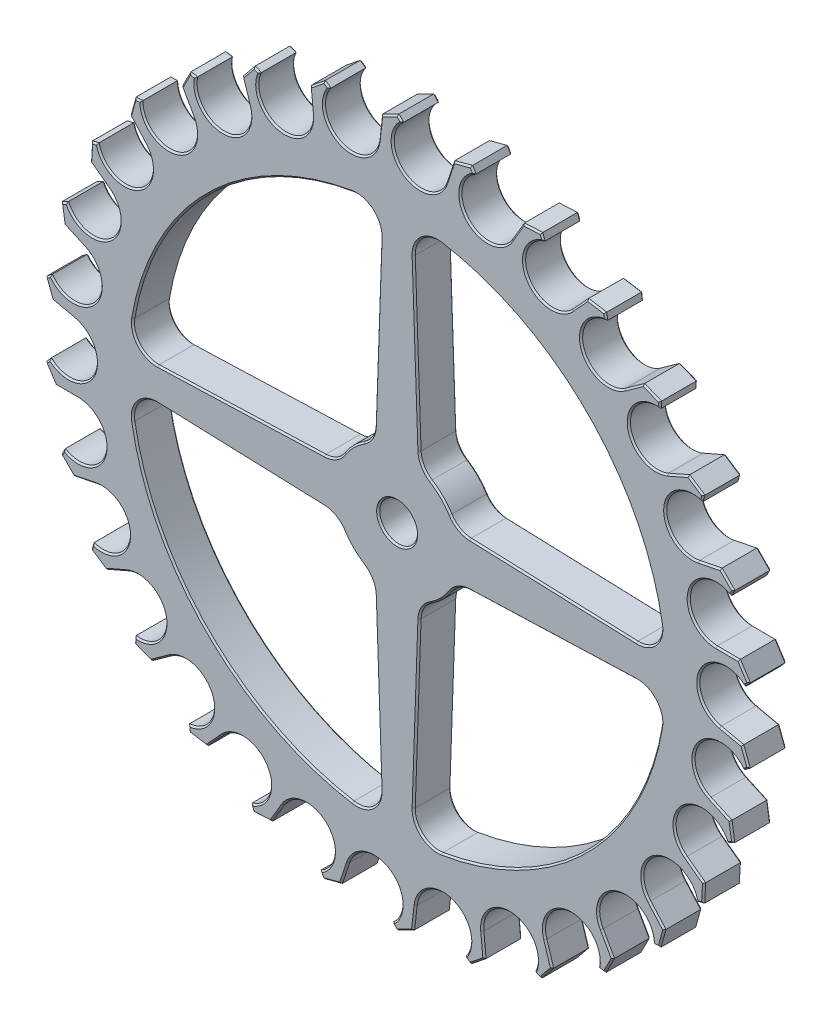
from build123d import *

# Parameters (mm, degrees)
SKETCH_1_R      = 3
EXTRUDE_1_DEPTH = 6
CHAMFER_1_SIZE  = 0.25


with BuildPart() as part:
    # Sketch 1 → Extrude 1 (new body)
    with BuildSketch(Plane.XY):
        with BuildLine():
            Line((-13.882887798, 53.121905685), (-13.530618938, 49.490786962))
            ThreePointArc((-13.530618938, 49.490786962), (-18.601788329, 44.784411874), (-21.797253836, 50.920838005))
            Line((-21.797253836, 50.920838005), (-22.788591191, 51.328605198))
            Line((-22.788591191, 51.328605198), (-24.624178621, 49.074649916))
            Line((-24.624178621, 49.074649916), (-23.524655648, 45.596120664))
            ThreePointArc((-23.524655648, 45.596120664), (-27.506497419, 39.938235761), (-31.90796907, 45.276191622))
            Line((-31.90796907, 45.276191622), (-32.962422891, 45.468937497))
            Line((-32.962422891, 45.468937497), (-34.289274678, 42.882596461))
            Line((-34.289274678, 42.882596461), (-32.490552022, 39.708685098))
            ThreePointArc((-32.490552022, 39.708685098), (-35.20904058, 33.3465671), (-40.624152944, 37.652758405))
            Line((-40.624152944, 37.652758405), (-41.69563854, 37.622059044))
            Line((-41.69563854, 37.622059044), (-42.455764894, 34.816367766))
            Line((-42.455764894, 34.816367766), (-40.036455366, 32.085789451))
            ThreePointArc((-40.036455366, 32.085789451), (-41.372779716, 25.297493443), (-47.564866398, 28.383718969))
            Line((-47.564866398, 28.383718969), (-48.606554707, 28.13091608))
            Line((-48.606554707, 28.13091608), (-48.766734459, 25.228496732))
            Line((-48.766734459, 25.228496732), (-45.832573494, 23.06059084))
            ThreePointArc((-45.832573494, 23.06059084), (-45.72832985, 16.142797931), (-52.426766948, 17.874174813))
            Line((-52.426766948, 17.874174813), (-53.393131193, 17.410317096))
            Line((-53.393131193, 17.410317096), (-52.946363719, 14.538019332))
            Line((-52.946363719, 14.538019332), (-49.625588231, 13.027533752))
            ThreePointArc((-49.625588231, 13.027533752), (-48.085332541, 6.282584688), (-54.997366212, 6.583443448))
            Line((-54.997366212, 6.583443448), (-55.846171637, 5.928803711))
            Line((-55.846171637, 5.928803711), (-54.81198282, 3.212160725))
            Line((-54.81198282, 3.212160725), (-51.249726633, 2.425110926))
            ThreePointArc((-51.249726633, 2.425110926), (-48.340775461, -3.852207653), (-55.164316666, -4.995015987))
            Line((-55.164316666, -4.995015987), (-55.858466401, -5.811826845))
            Line((-55.858466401, -5.811826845), (-54.282055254, -8.254084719))
            Line((-54.282055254, -8.254084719), (-50.634006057, -8.283300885))
            ThreePointArc((-50.634006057, -8.283300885), (-46.483494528, -13.818640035), (-52.920321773, -16.355169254))
            Line((-52.920321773, -16.355169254), (-53.429478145, -17.298452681))
            Line((-53.429478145, -17.298452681), (-51.3797414, -19.359587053))
            Line((-51.3797414, -19.359587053), (-47.805336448, -18.629692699))
            ThreePointArc((-47.805336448, -18.629692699), (-42.594661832, -23.181131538), (-48.363454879, -27.000523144))
            Line((-48.363454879, -27.000523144), (-48.665365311, -28.029053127))
            Line((-48.665365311, -28.029053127), (-46.231886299, -29.618982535))
            Line((-46.231886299, -29.618982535), (-42.88734424, -28.161877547))
            ThreePointArc((-42.88734424, -28.161877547), (-36.844238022, -31.530496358), (-41.692872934, -36.465824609))
            Line((-41.692872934, -36.465824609), (-41.77434249, -37.534649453))
            Line((-41.77434249, -37.534649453), (-39.063475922, -38.583886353))
            Line((-39.063475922, -38.583886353), (-36.094969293, -36.46325321))
            ThreePointArc((-36.094969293, -36.46325321), (-29.483544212, -38.501827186), (-33.200112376, -44.337394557))
            Line((-33.200112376, -44.337394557), (-33.057580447, -45.399801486))
            Line((-33.057580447, -45.399801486), (-30.187804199, -45.862489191))
            Line((-30.187804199, -45.862489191), (-27.725070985, -43.171009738))
            ThreePointArc((-27.725070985, -43.171009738), (-20.834278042, -43.790443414), (-23.256347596, -50.271207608))
            Line((-23.256347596, -50.271207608), (-22.89604351, -51.280764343))
            Line((-22.89604351, -51.280764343), (-19.992780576, -51.136681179))
            Line((-19.992780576, -51.136681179), (-18.143454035, -47.991985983))
            ThreePointArc((-18.143454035, -47.991985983), (-11.274453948, -47.165207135), (-12.29616883, -54.007927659))
            Line((-12.29616883, -54.007927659), (-11.733839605, -54.920511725))
            Line((-11.733839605, -54.920511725), (-8.923976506, -54.175954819))
            Line((-8.923976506, -54.175954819), (-7.768881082, -50.71548215))
            ThreePointArc((-7.768881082, -50.71548215), (-1.221882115, -48.478624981), (-0.798588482, -55.384242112))
            Line((-0.798588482, -55.384242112), (-0.058810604, -56.159969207))
            Line((-0.058810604, -56.159969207), (2.53484816, -54.847479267))
            Line((2.53484816, -54.847479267), (2.945229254, -51.222468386))
            ThreePointArc((2.945229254, -51.222468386), (8.884091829, -47.673294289), (10.733894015, -54.339999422))
            Line((10.733894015, -54.339999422), (11.618788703, -54.944966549))
            Line((11.618788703, -54.944966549), (13.882887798, -53.121905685))
            Line((13.882887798, -53.121905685), (13.530618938, -49.490786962))
            ThreePointArc((13.530618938, -49.490786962), (18.601788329, -44.784411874), (21.797253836, -50.920838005))
            Line((21.797253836, -50.920838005), (22.788591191, -51.328605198))
            Line((22.788591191, -51.328605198), (24.624178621, -49.074649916))
            Line((24.624178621, -49.074649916), (23.524655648, -45.596120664))
            ThreePointArc((23.524655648, -45.596120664), (27.506497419, -39.938235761), (31.90796907, -45.276191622))
            Line((31.90796907, -45.276191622), (32.962422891, -45.468937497))
            Line((32.962422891, -45.468937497), (34.289274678, -42.882596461))
            Line((34.289274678, -42.882596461), (32.490552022, -39.708685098))
            ThreePointArc((32.490552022, -39.708685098), (35.20904058, -33.3465671), (40.624152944, -37.652758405))
            Line((40.624152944, -37.652758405), (41.69563854, -37.622059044))
            Line((41.69563854, -37.622059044), (42.455764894, -34.816367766))
            Line((42.455764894, -34.816367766), (40.036455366, -32.085789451))
            ThreePointArc((40.036455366, -32.085789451), (41.372779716, -25.297493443), (47.564866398, -28.383718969))
            Line((47.564866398, -28.383718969), (48.606554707, -28.13091608))
            Line((48.606554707, -28.13091608), (48.766734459, -25.228496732))
            Line((48.766734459, -25.228496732), (45.832573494, -23.06059084))
            ThreePointArc((45.832573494, -23.06059084), (45.72832985, -16.142797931), (52.426766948, -17.874174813))
            Line((52.426766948, -17.874174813), (53.393131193, -17.410317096))
            Line((53.393131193, -17.410317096), (52.946363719, -14.538019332))
            Line((52.946363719, -14.538019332), (49.625588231, -13.027533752))
            ThreePointArc((49.625588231, -13.027533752), (48.085332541, -6.282584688), (54.997366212, -6.583443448))
            Line((54.997366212, -6.583443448), (55.846171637, -5.928803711))
            Line((55.846171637, -5.928803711), (54.81198282, -3.212160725))
            Line((54.81198282, -3.212160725), (51.249726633, -2.425110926))
            ThreePointArc((51.249726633, -2.425110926), (48.340775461, 3.852207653), (55.164316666, 4.995015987))
            Line((55.164316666, 4.995015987), (55.858466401, 5.811826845))
            Line((55.858466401, 5.811826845), (54.282055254, 8.254084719))
            Line((54.282055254, 8.254084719), (50.634006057, 8.283300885))
            ThreePointArc((50.634006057, 8.283300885), (46.483494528, 13.818640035), (52.920321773, 16.355169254))
            Line((52.920321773, 16.355169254), (53.429478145, 17.298452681))
            Line((53.429478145, 17.298452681), (51.3797414, 19.359587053))
            Line((51.3797414, 19.359587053), (47.805336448, 18.629692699))
            ThreePointArc((47.805336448, 18.629692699), (42.594661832, 23.181131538), (48.363454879, 27.000523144))
            Line((48.363454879, 27.000523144), (48.665365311, 28.029053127))
            Line((48.665365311, 28.029053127), (46.231886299, 29.618982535))
            Line((46.231886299, 29.618982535), (42.88734424, 28.161877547))
            ThreePointArc((42.88734424, 28.161877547), (36.844238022, 31.530496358), (41.692872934, 36.465824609))
            Line((41.692872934, 36.465824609), (41.77434249, 37.534649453))
            Line((41.77434249, 37.534649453), (39.063475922, 38.583886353))
            Line((39.063475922, 38.583886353), (36.094969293, 36.46325321))
            ThreePointArc((36.094969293, 36.46325321), (29.483544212, 38.501827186), (33.200112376, 44.337394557))
            Line((33.200112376, 44.337394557), (33.057580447, 45.399801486))
            Line((33.057580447, 45.399801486), (30.187804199, 45.862489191))
            Line((30.187804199, 45.862489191), (27.725070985, 43.171009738))
            ThreePointArc((27.725070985, 43.171009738), (20.834278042, 43.790443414), (23.256347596, 50.271207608))
            Line((23.256347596, 50.271207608), (22.89604351, 51.280764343))
            Line((22.89604351, 51.280764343), (19.992780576, 51.136681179))
            Line((19.992780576, 51.136681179), (18.143454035, 47.991985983))
            ThreePointArc((18.143454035, 47.991985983), (11.274453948, 47.165207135), (12.29616883, 54.007927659))
            Line((12.29616883, 54.007927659), (11.733839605, 54.920511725))
            Line((11.733839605, 54.920511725), (8.923976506, 54.175954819))
            Line((8.923976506, 54.175954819), (7.768881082, 50.71548215))
            ThreePointArc((7.768881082, 50.71548215), (1.221882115, 48.478624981), (0.798588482, 55.384242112))
            Line((0.798588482, 55.384242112), (0.058810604, 56.159969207))
            Line((0.058810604, 56.159969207), (-2.53484816, 54.847479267))
            Line((-2.53484816, 54.847479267), (-2.945229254, 51.222468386))
            ThreePointArc((-2.945229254, 51.222468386), (-8.884091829, 47.673294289), (-10.733894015, 54.339999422))
            Line((-10.733894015, 54.339999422), (-11.618788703, 54.944966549))
            Line((-11.618788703, 54.944966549), (-13.882887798, 53.121905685))
        make_face()
        Circle(SKETCH_1_R, mode=Mode.SUBTRACT)
        with BuildLine():
            Line((-38.017296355, 2.63231316), (-11.549658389, 3.556583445))
            ThreePointArc((-11.549658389, 3.556583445), (-9.784128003, 4.060960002), (-8.459540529, 5.332557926))
            ThreePointArc((-8.459540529, 5.332557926), (-7.071067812, 7.071067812), (-5.332557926, 8.459540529))
            ThreePointArc((-5.332557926, 8.459540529), (-4.060960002, 9.784128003), (-3.556583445, 11.549658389))
            Line((-3.556583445, 11.549658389), (-2.63231316, 38.017296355))
            ThreePointArc((-2.63231316, 38.017296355), (-3.929923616, 41.016559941), (-7.074170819, 41.907112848))
            ThreePointArc((-7.074170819, 41.907112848), (-30.0520382, 30.0520382), (-41.907112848, 7.074170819))
            ThreePointArc((-41.907112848, 7.074170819), (-41.016559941, 3.929923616), (-38.017296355, 2.63231316))
        make_face(mode=Mode.SUBTRACT)
        with BuildLine():
            Line((38.017296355, 2.63231316), (11.549658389, 3.556583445))
            ThreePointArc((11.549658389, 3.556583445), (9.784128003, 4.060960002), (8.459540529, 5.332557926))
            ThreePointArc((8.459540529, 5.332557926), (7.071067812, 7.071067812), (5.332557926, 8.459540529))
            ThreePointArc((5.332557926, 8.459540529), (4.060960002, 9.784128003), (3.556583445, 11.549658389))
            Line((3.556583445, 11.549658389), (2.63231316, 38.017296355))
            ThreePointArc((2.63231316, 38.017296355), (3.929923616, 41.016559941), (7.074170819, 41.907112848))
            ThreePointArc((7.074170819, 41.907112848), (30.0520382, 30.0520382), (41.907112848, 7.074170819))
            ThreePointArc((41.907112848, 7.074170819), (41.016559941, 3.929923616), (38.017296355, 2.63231316))
        make_face(mode=Mode.SUBTRACT)
        with BuildLine():
            Line((2.63231316, -38.017296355), (3.556583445, -11.549658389))
            ThreePointArc((3.556583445, -11.549658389), (4.060960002, -9.784128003), (5.332557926, -8.459540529))
            ThreePointArc((5.332557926, -8.459540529), (7.071067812, -7.071067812), (8.459540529, -5.332557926))
            ThreePointArc((8.459540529, -5.332557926), (9.784128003, -4.060960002), (11.549658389, -3.556583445))
            Line((11.549658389, -3.556583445), (38.017296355, -2.63231316))
            ThreePointArc((38.017296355, -2.63231316), (41.016559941, -3.929923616), (41.907112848, -7.074170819))
            ThreePointArc((41.907112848, -7.074170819), (30.0520382, -30.0520382), (7.074170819, -41.907112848))
            ThreePointArc((7.074170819, -41.907112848), (3.929923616, -41.016559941), (2.63231316, -38.017296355))
        make_face(mode=Mode.SUBTRACT)
        with BuildLine():
            Line((-38.017296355, -2.63231316), (-11.549658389, -3.556583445))
            ThreePointArc((-11.549658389, -3.556583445), (-9.784128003, -4.060960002), (-8.459540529, -5.332557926))
            ThreePointArc((-8.459540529, -5.332557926), (-7.071067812, -7.071067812), (-5.332557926, -8.459540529))
            ThreePointArc((-5.332557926, -8.459540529), (-4.060960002, -9.784128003), (-3.556583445, -11.549658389))
            Line((-3.556583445, -11.549658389), (-2.63231316, -38.017296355))
            ThreePointArc((-2.63231316, -38.017296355), (-3.929923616, -41.016559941), (-7.074170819, -41.907112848))
            ThreePointArc((-7.074170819, -41.907112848), (-30.0520382, -30.0520382), (-41.907112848, -7.074170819))
            ThreePointArc((-41.907112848, -7.074170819), (-41.016559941, -3.929923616), (-38.017296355, -2.63231316))
        make_face(mode=Mode.SUBTRACT)
    extrude(amount=EXTRUDE_1_DEPTH)

    # Chamfer 1
    chamfer_1_edges = [part.edges().sort_by_distance(p)[0] for p in [
        (-18.601788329, 44.784411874, 6),
        (-52.404609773, -18.329019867, 6),
        (10.328908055, 54.548233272, 0),
        (12.015004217, 54.464219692, 0),
        (11.274453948, 47.165207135, 0),
        (19.068117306, 49.564333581, 0),
        (21.444412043, 51.208722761, 0),
        (23.076195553, 50.775985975, 0),
        (20.834278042, 43.790443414, 0),
        (28.956437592, 44.516749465, 0),
        (-49.592538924, -18.994639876, 6),
        (31.622692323, 45.631145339, 0),
        (33.128846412, 44.868598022, 0),
        (29.483544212, 38.501827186, 0),
        (37.579222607, 37.523569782, 0),
        (40.418909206, 38.059267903, 0),
        (41.733607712, 37.000237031, 0),
        (36.844238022, 31.530496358, 0),
        (-42.594661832, -23.181131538, 6),
        (44.55961527, 28.890430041, 0),
        (47.448625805, 28.824017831, 0),
        (48.514410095, 27.514788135, 0),
        (42.594661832, 23.181131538, 0),
        (49.592538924, 18.994639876, 0),
        (52.404609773, 18.329019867, 0),
        (53.174899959, 16.826810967, 0),
        (46.483494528, 13.818640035, 0),
        (-48.514410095, -27.514788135, 6),
        (52.458030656, 8.268692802, 0),
        (55.070260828, 7.032955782, 0),
        (55.511391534, 5.403421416, 0),
        (48.340775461, 3.852207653, 0),
        (53.030854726, -2.818635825, 0),
        (55.329077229, -4.570482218, 0),
        (55.421768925, -6.25612358, 0),
        (-47.448625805, -28.824017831, 6),
        (48.085332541, -6.282584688, 0),
        (51.285975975, -13.782776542, 0),
        (53.169747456, -15.974168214, 0),
        (52.909949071, -17.642245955, 0),
        (45.72832985, -16.142797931, 0),
        (47.299653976, -24.144543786, 0),
        (48.686644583, -26.679706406, 0),
        (48.085710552, -28.257317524, 0),
        (-44.55961527, -28.890430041, 6),
        (41.372779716, -25.297493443, 0),
        (41.24611013, -33.451078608, 0),
        (42.075701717, -36.219213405, 0),
        (41.159895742, -37.637408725, 0),
        (35.20904058, -33.3465671, 0),
        (33.38991335, -41.29564078, 0),
        (33.625848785, -44.175766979, 0),
        (-36.844238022, -31.530496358, 6),
        (32.43519598, -45.37256456, 0),
        (27.506497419, -39.938235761, 0),
        (24.074417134, -47.33538529, 0),
        (23.706384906, -50.201627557, 0),
        (22.292922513, -51.124721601, 0),
        (18.601788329, -44.784411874, 0),
        (13.706753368, -51.306346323, 0),
        (12.75083825, -54.033436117, 0),
        (-41.733607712, -37.000237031, 6),
        (11.176341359, -54.642482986, 0),
        (8.884091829, -47.673294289, 0),
        (2.740038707, -53.034973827, 0),
        (1.238018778, -55.503724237, 0),
        (-0.428699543, -55.77210566, 0),
        (-1.221882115, -48.478624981, 0),
        (-8.346428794, -52.445718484, 0),
        (-40.418909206, -38.059267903, 6),
        (-10.328908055, -54.548233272, 0),
        (-12.015004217, -54.464219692, 0),
        (-11.274453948, -47.165207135, 0),
        (-19.068117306, -49.564333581, 0),
        (-21.444412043, -51.208722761, 0),
        (-23.076195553, -50.775985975, 0),
        (-20.834278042, -43.790443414, 0),
        (-28.956437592, -44.516749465, 0),
        (-37.579222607, -37.523569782, 6),
        (-31.622692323, -45.631145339, 0),
        (-33.128846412, -44.868598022, 0),
        (-29.483544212, -38.501827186, 0),
        (-37.579222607, -37.523569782, 0),
        (-40.418909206, -38.059267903, 0),
        (-41.733607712, -37.000237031, 0),
        (-36.844238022, -31.530496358, 0),
        (-22.292922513, 51.124721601, 6),
        (-29.483544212, -38.501827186, 6),
        (-44.55961527, -28.890430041, 0),
        (-47.448625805, -28.824017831, 0),
        (-48.514410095, -27.514788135, 0),
        (-42.594661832, -23.181131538, 0),
        (-49.592538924, -18.994639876, 0),
        (-52.404609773, -18.329019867, 0),
        (-53.174899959, -16.826810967, 0),
        (-46.483494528, -13.818640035, 0),
        (-33.128846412, -44.868598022, 6),
        (-52.458030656, -8.268692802, 0),
        (-55.070260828, -7.032955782, 0),
        (-55.511391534, -5.403421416, 0),
        (-48.340775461, -3.852207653, 0),
        (-53.030854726, 2.818635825, 0),
        (-55.329077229, 4.570482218, 0),
        (-55.421768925, 6.25612358, 0),
        (-31.622692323, -45.631145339, 6),
        (-48.085332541, 6.282584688, 0),
        (-51.285975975, 13.782776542, 0),
        (-53.169747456, 15.974168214, 0),
        (-52.909949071, 17.642245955, 0),
        (-45.72832985, 16.142797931, 0),
        (-47.299653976, 24.144543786, 0),
        (-48.686644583, 26.679706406, 0),
        (-48.085710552, 28.257317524, 0),
        (-28.956437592, -44.516749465, 6),
        (-41.372779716, 25.297493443, 0),
        (-41.24611013, 33.451078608, 0),
        (-42.075701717, 36.219213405, 0),
        (-41.159895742, 37.637408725, 0),
        (-35.20904058, 33.3465671, 0),
        (-33.38991335, 41.29564078, 0),
        (-33.625848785, 44.175766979, 0),
        (-20.834278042, -43.790443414, 6),
        (-32.43519598, 45.37256456, 0),
        (-27.506497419, 39.938235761, 0),
        (-24.074417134, 47.33538529, 0),
        (-23.706384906, 50.201627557, 0),
        (-22.292922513, 51.124721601, 0),
        (-18.601788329, 44.784411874, 0),
        (-13.706753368, 51.306346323, 0),
        (-12.75083825, 54.033436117, 0),
        (-23.076195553, -50.775985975, 6),
        (-21.444412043, -51.208722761, 6),
        (-19.068117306, -49.564333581, 6),
        (-11.274453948, -47.165207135, 6),
        (-12.015004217, -54.464219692, 6),
        (-23.706384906, 50.201627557, 6),
        (-10.328908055, -54.548233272, 6),
        (-8.346428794, -52.445718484, 6),
        (-1.221882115, -48.478624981, 6),
        (-0.428699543, -55.77210566, 6),
        (1.238018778, -55.503724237, 6),
        (2.740038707, -53.034973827, 6),
        (8.884091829, -47.673294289, 6),
        (11.176341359, -54.642482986, 6),
        (12.75083825, -54.033436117, 6),
        (13.706753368, -51.306346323, 6),
        (-24.074417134, 47.33538529, 6),
        (18.601788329, -44.784411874, 6),
        (22.292922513, -51.124721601, 6),
        (23.706384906, -50.201627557, 6),
        (24.074417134, -47.33538529, 6),
        (27.506497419, -39.938235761, 6),
        (32.43519598, -45.37256456, 6),
        (33.625848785, -44.175766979, 6),
        (33.38991335, -41.29564078, 6),
        (35.20904058, -33.3465671, 6),
        (41.159895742, -37.637408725, 6),
        (-27.506497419, 39.938235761, 6),
        (42.075701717, -36.219213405, 6),
        (41.24611013, -33.451078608, 6),
        (41.372779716, -25.297493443, 6),
        (48.085710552, -28.257317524, 6),
        (48.686644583, -26.679706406, 6),
        (47.299653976, -24.144543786, 6),
        (45.72832985, -16.142797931, 6),
        (52.909949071, -17.642245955, 6),
        (53.169747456, -15.974168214, 6),
        (51.285975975, -13.782776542, 6),
        (-32.43519598, 45.37256456, 6),
        (48.085332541, -6.282584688, 6),
        (55.421768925, -6.25612358, 6),
        (55.329077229, -4.570482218, 6),
        (53.030854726, -2.818635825, 6),
        (48.340775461, 3.852207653, 6),
        (55.511391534, 5.403421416, 6),
        (-3, 0, 0),
        (-3, 0, 6),
        (55.070260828, 7.032955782, 6),
        (52.458030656, 8.268692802, 6),
        (46.483494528, 13.818640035, 6),
        (53.174899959, 16.826810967, 6),
        (-4.060960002, 9.784128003, 0),
        (-3.094448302, 24.783477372, 0),
        (-3.929923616, 41.016559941, 0),
        (-30.0520382, 30.0520382, 0),
        (-41.016559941, 3.929923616, 0),
        (-24.783477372, 3.094448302, 0),
        (-9.784128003, 4.060960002, 0),
        (-7.071067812, 7.071067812, 0),
        (-33.625848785, 44.175766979, 6),
        (52.404609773, 18.329019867, 6),
        (-4.060960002, 9.784128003, 6),
        (-3.094448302, 24.783477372, 6),
        (-3.929923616, 41.016559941, 6),
        (-30.0520382, 30.0520382, 6),
        (-41.016559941, 3.929923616, 6),
        (-24.783477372, 3.094448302, 6),
        (-9.784128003, 4.060960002, 6),
        (-7.071067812, 7.071067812, 6),
        (49.592538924, 18.994639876, 6),
        (42.594661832, 23.181131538, 6),
        (48.514410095, 27.514788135, 6),
        (47.448625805, 28.824017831, 6),
        (44.55961527, 28.890430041, 6),
        (36.844238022, 31.530496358, 6),
        (9.784128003, 4.060960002, 0),
        (41.733607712, 37.000237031, 6),
        (24.783477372, 3.094448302, 0),
        (41.016559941, 3.929923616, 0),
        (30.0520382, 30.0520382, 0),
        (3.929923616, 41.016559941, 0),
        (3.094448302, 24.783477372, 0),
        (4.060960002, 9.784128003, 0),
        (7.071067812, 7.071067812, 0),
        (40.418909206, 38.059267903, 6),
        (9.784128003, 4.060960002, 6),
        (24.783477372, 3.094448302, 6),
        (41.016559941, 3.929923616, 6),
        (30.0520382, 30.0520382, 6),
        (3.929923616, 41.016559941, 6),
        (3.094448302, 24.783477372, 6),
        (4.060960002, 9.784128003, 6),
        (7.071067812, 7.071067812, 6),
        (37.579222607, 37.523569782, 6),
        (-33.38991335, 41.29564078, 6),
        (29.483544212, 38.501827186, 6),
        (33.128846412, 44.868598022, 6),
        (31.622692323, 45.631145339, 6),
        (28.956437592, 44.516749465, 6),
        (20.834278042, 43.790443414, 6),
        (4.060960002, -9.784128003, 0),
        (23.076195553, 50.775985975, 6),
        (3.094448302, -24.783477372, 0),
        (3.929923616, -41.016559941, 0),
        (30.0520382, -30.0520382, 0),
        (41.016559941, -3.929923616, 0),
        (24.783477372, -3.094448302, 0),
        (9.784128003, -4.060960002, 0),
        (7.071067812, -7.071067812, 0),
        (4.060960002, -9.784128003, 6),
        (21.444412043, 51.208722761, 6),
        (3.094448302, -24.783477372, 6),
        (3.929923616, -41.016559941, 6),
        (30.0520382, -30.0520382, 6),
        (41.016559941, -3.929923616, 6),
        (24.783477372, -3.094448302, 6),
        (9.784128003, -4.060960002, 6),
        (7.071067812, -7.071067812, 6),
        (19.068117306, 49.564333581, 6),
        (11.274453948, 47.165207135, 6),
        (12.015004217, 54.464219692, 6),
        (-35.20904058, 33.3465671, 6),
        (10.328908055, 54.548233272, 6),
        (8.346428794, 52.445718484, 6),
        (1.221882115, 48.478624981, 6),
        (-9.784128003, -4.060960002, 0),
        (-24.783477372, -3.094448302, 0),
        (0.428699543, 55.77210566, 6),
        (-41.016559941, -3.929923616, 0),
        (-30.0520382, -30.0520382, 0),
        (-3.929923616, -41.016559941, 0),
        (-3.094448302, -24.783477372, 0),
        (-4.060960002, -9.784128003, 0),
        (-7.071067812, -7.071067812, 0),
        (-9.784128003, -4.060960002, 6),
        (-24.783477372, -3.094448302, 6),
        (-1.238018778, 55.503724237, 6),
        (-41.016559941, -3.929923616, 6),
        (-30.0520382, -30.0520382, 6),
        (-3.929923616, -41.016559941, 6),
        (-3.094448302, -24.783477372, 6),
        (-4.060960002, -9.784128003, 6),
        (-7.071067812, -7.071067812, 6),
        (-2.740038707, 53.034973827, 6),
        (-8.884091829, 47.673294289, 6),
        (-11.176341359, 54.642482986, 6),
        (-41.159895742, 37.637408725, 6),
        (-12.75083825, 54.033436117, 6),
        (-42.075701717, 36.219213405, 6),
        (-41.24611013, 33.451078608, 6),
        (-41.372779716, 25.297493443, 6),
        (-48.085710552, 28.257317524, 6),
        (-48.686644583, 26.679706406, 6),
        (-47.299653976, 24.144543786, 6),
        (-45.72832985, 16.142797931, 6),
        (-52.909949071, 17.642245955, 6),
        (-53.169747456, 15.974168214, 6),
        (-51.285975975, 13.782776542, 6),
        (-13.706753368, 51.306346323, 6),
        (-48.085332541, 6.282584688, 6),
        (-55.421768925, 6.25612358, 6),
        (-55.329077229, 4.570482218, 6),
        (-53.030854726, 2.818635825, 6),
        (-48.340775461, -3.852207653, 6),
        (-55.511391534, -5.403421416, 6),
        (-55.070260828, -7.032955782, 6),
        (-52.458030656, -8.268692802, 6),
        (-46.483494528, -13.818640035, 6),
        (-53.174899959, -16.826810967, 6),
        (-11.176341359, 54.642482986, 0),
        (-8.884091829, 47.673294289, 0),
        (-2.740038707, 53.034973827, 0),
        (-1.238018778, 55.503724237, 0),
        (0.428699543, 55.77210566, 0),
        (1.221882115, 48.478624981, 0),
        (8.346428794, 52.445718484, 0),
    ]]
    chamfer(chamfer_1_edges, length=CHAMFER_1_SIZE)


solid = part.part
